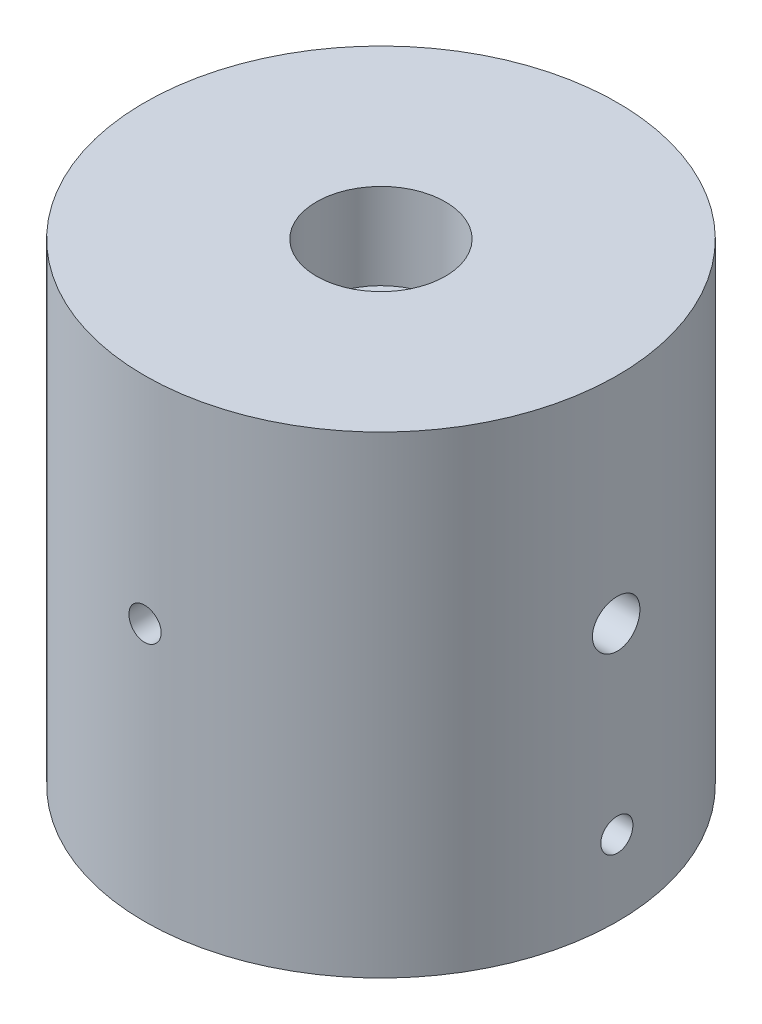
from build123d import *

# Parameters (mm, degrees)
SKETCH1_R                         = 17.4625
SKETCH1_R_2                       = 3.175
EXTRUDE1_DEPTH                    = 34.925
F_3_32_0_09375_DIAMETER_HOLE3_D   = 2.3749
CIRPATTERN1_COUNT                 = 2
CUT_EXTRUDE1_DEPTH                = 43.774214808
CUT_EXTRUDE1_DEPTH_BACK           = 43.774214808
SKETCH8_R                         = 1.18999
F_3_8_32_TAPPED_HOLE1_D           = 8.4328
F_3_8_32_TAPPED_HOLE1_DEPTH       = 11.6459
F_3_8_32_TAPPED_HOLE1_CBORE_D     = 9.525
F_3_8_32_TAPPED_HOLE1_CBORE_DEPTH = 6.35
F_3_8_32_TAPPED_HOLE1_TIP         = 2.533468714


with BuildPart() as part:
    # Sketch1 → Extrude1 (new body)
    with BuildSketch(Plane(origin=(0, 0, 0), x_dir=(1, 0, 0), z_dir=(0, 1, 0))):
        with Locations(Location((0, 0, 0), (0, 0, 270))):
            Circle(SKETCH1_R)
        with Locations(Location((0, 0, 0), (0, 0, 270))):
            Circle(SKETCH1_R_2, mode=Mode.SUBTRACT)
    extrude(amount=EXTRUDE1_DEPTH)

    # 3_32 _0.09375_ Diameter Hole3 (through all)
    with Locations(Plane(origin=(17.526, 0, 0), x_dir=(0, 0, -1), z_dir=(1, 0, 0))):
        with Locations((0, 5.5626)):
            Hole(F_3_32_0_09375_DIAMETER_HOLE3_D / 2)

    # Sketch6 → 6-32 Tapped Hole1 (revolve, cut)
    with BuildSketch(Plane(origin=(17.526, 19.05, 0), x_dir=(0, 0, -1), z_dir=(0, 1, 0))):
        Polygon((0, 0), (0, 16.68769403), (1.35255, 15.875), (1.35255, 7.9375), (1.7526, 7.9375), (1.7526, 0), align=None)
    f_6_32_tapped_hole1 = revolve(axis=Axis((23.876, 19.05, 0), (-1, 0, 0)), mode=Mode.SUBTRACT)

    # CirPattern1: 6-32 Tapped Hole1 ×2 about axis
    cirpattern1_axis = Axis((0, 34.925, 0), (0, -1, 0))
    for i in range(1, CIRPATTERN1_COUNT):
        add(f_6_32_tapped_hole1.rotate(cirpattern1_axis, i * 360 / CIRPATTERN1_COUNT), mode=Mode.SUBTRACT)

    # Sketch8 → Cut-Extrude1 (cut, two sides: drawn at the far end of the back side and taken through both)
    with BuildSketch(Plane.XY.offset(-CUT_EXTRUDE1_DEPTH_BACK)):
        with Locations((0, 19.05)):
            Circle(SKETCH8_R)
    extrude(amount=CUT_EXTRUDE1_DEPTH + CUT_EXTRUDE1_DEPTH_BACK, mode=Mode.SUBTRACT)

    # 3_8-32 Tapped Hole1
    with Locations(Plane(origin=(0, 34.925, 0), x_dir=(-1, 0, 0), z_dir=(0, 1, 0))):
        with Locations((0, 0)):
            CounterBoreHole(F_3_8_32_TAPPED_HOLE1_D / 2, F_3_8_32_TAPPED_HOLE1_CBORE_D / 2, F_3_8_32_TAPPED_HOLE1_CBORE_DEPTH, depth=F_3_8_32_TAPPED_HOLE1_DEPTH)
            with Locations((0, 0, -(F_3_8_32_TAPPED_HOLE1_DEPTH + F_3_8_32_TAPPED_HOLE1_TIP / 2))):  # 118° drill point
                Cone(0, F_3_8_32_TAPPED_HOLE1_D / 2, F_3_8_32_TAPPED_HOLE1_TIP, mode=Mode.SUBTRACT)


solid = part.part
